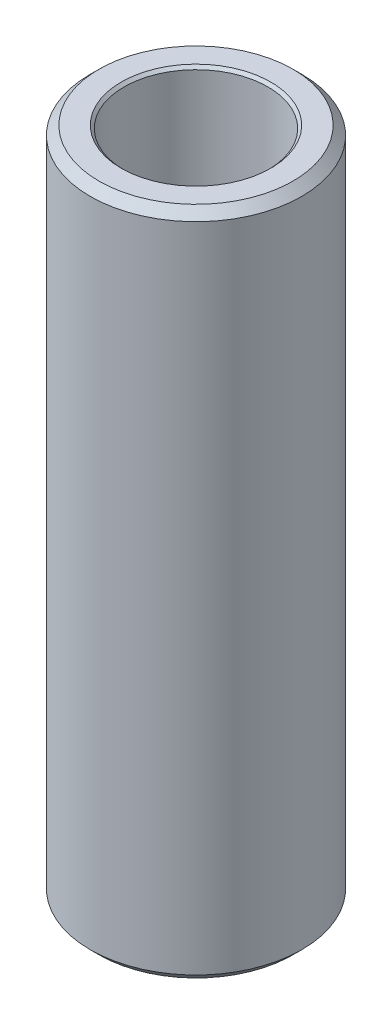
from build123d import *

# Parameters (mm, degrees)
SKETCH1_W     = 3.048
SKETCH1_H     = 60.325
CHAMFER1_SIZE = 0.79375
CHAMFER2_SIZE = 0.254


with BuildPart() as part:
    # Sketch1 → Base-Revolve (revolve)
    with BuildSketch(Plane.XY, mode=Mode.PRIVATE) as base_revolve_sk:
        with Locations((8.001, 30.1625)):
            Rectangle(SKETCH1_W, SKETCH1_H)
    revolve(base_revolve_sk.sketch.rotate(Axis((0, 64.77, 0), (0, -1, 0)), 90), axis=Axis((0, 64.77, 0), (0, -1, 0)))

    # Chamfer1
    chamfer1_edges = [part.edges().sort_by_distance(p)[0] for p in [
        (0, 60.325, -9.525),
        (0, 0, -9.525),
    ]]
    chamfer(chamfer1_edges, length=CHAMFER1_SIZE)

    # Chamfer2
    chamfer2_edges = [part.edges().sort_by_distance(p)[0] for p in [
        (0, 60.325, -6.477),
        (0, 0, -6.477),
    ]]
    chamfer(chamfer2_edges, length=CHAMFER2_SIZE)


solid = part.part
